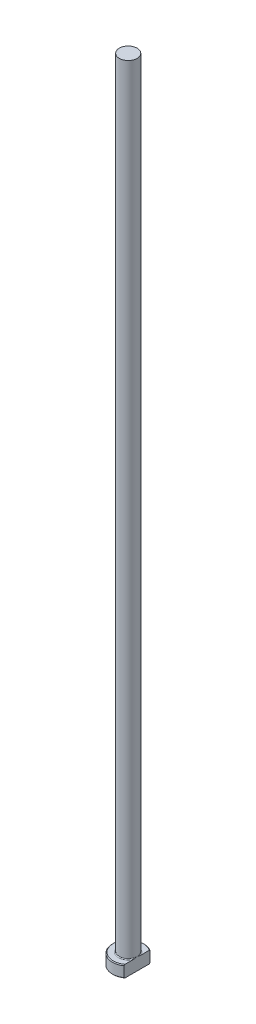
ISO-10303-21;
HEADER;
FILE_DESCRIPTION(('STEP AP214'),'2;1');
FILE_NAME('part.step','',(''),(''),'','','');
FILE_SCHEMA(('AUTOMOTIVE_DESIGN { 1 0 10303 214 1 1 1 1 }'));
ENDSEC;
DATA;
#1=APPLICATION_CONTEXT('core data for automotive mechanical design processes');
#2=APPLICATION_PROTOCOL_DEFINITION('international standard','automotive_design',2000,#1);
#3=PRODUCT_CONTEXT('',#1,'mechanical');
#4=PRODUCT('Part','Part','',(#3));
#5=PRODUCT_RELATED_PRODUCT_CATEGORY('part','',(#4));
#6=PRODUCT_DEFINITION_FORMATION('','',#4);
#7=PRODUCT_DEFINITION_CONTEXT('part definition',#1,'design');
#8=PRODUCT_DEFINITION('design','',#6,#7);
#9=PRODUCT_DEFINITION_SHAPE('','',#8);
#10=(LENGTH_UNIT() NAMED_UNIT(*) SI_UNIT(.MILLI.,.METRE.));
#11=(NAMED_UNIT(*) PLANE_ANGLE_UNIT() SI_UNIT($,.RADIAN.));
#12=(NAMED_UNIT(*) SI_UNIT($,.STERADIAN.) SOLID_ANGLE_UNIT());
#13=UNCERTAINTY_MEASURE_WITH_UNIT(LENGTH_MEASURE(1.E-05),#10,'distance_accuracy_value','');
#14=(GEOMETRIC_REPRESENTATION_CONTEXT(3) GLOBAL_UNCERTAINTY_ASSIGNED_CONTEXT((#13)) GLOBAL_UNIT_ASSIGNED_CONTEXT((#10,
#11,#12)) REPRESENTATION_CONTEXT('',''));
#15=CARTESIAN_POINT('',(0.,0.,0.));
#16=DIRECTION('',(0.,0.,1.));
#17=DIRECTION('',(1.,0.,0.));
#18=AXIS2_PLACEMENT_3D('',#15,#16,#17);
#19=CARTESIAN_POINT('',(0.,0.,0.));
#20=DIRECTION('',(0.,-1.,0.));
#21=DIRECTION('',(0.,0.,-1.));
#22=AXIS2_PLACEMENT_3D('',#19,#20,#21);
#23=PLANE('',#22);
#24=CARTESIAN_POINT('',(0.,0.,0.));
#25=DIRECTION('',(0.,-1.,0.));
#26=DIRECTION('',(0.,0.,-1.));
#27=AXIS2_PLACEMENT_3D('',#24,#25,#26);
#28=CIRCLE('',#27,3.79999999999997);
#29=CARTESIAN_POINT('',(2.24999999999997,0.,3.0622703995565));
#30=VERTEX_POINT('',#29);
#31=CARTESIAN_POINT('',(2.24999999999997,0.,-3.0622703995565));
#32=VERTEX_POINT('',#31);
#33=EDGE_CURVE('E98',#30,#32,#28,.T.);
#34=ORIENTED_EDGE('',*,*,#33,.T.);
#35=DIRECTION('',(0.,0.,1.));
#36=VECTOR('',#35,1.);
#37=CARTESIAN_POINT('',(2.24999999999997,0.,-3.30718913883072));
#38=LINE('',#37,#36);
#39=EDGE_CURVE('E83',#32,#30,#38,.T.);
#40=ORIENTED_EDGE('',*,*,#39,.T.);
#41=EDGE_LOOP('',(#34,#40));
#42=FACE_BOUND('',#41,.T.);
#43=ADVANCED_FACE('F32',(#42),#23,.T.);
#44=CARTESIAN_POINT('',(0.,259.958771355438,0.));
#45=DIRECTION('',(0.,1.,0.));
#46=DIRECTION('',(0.,0.,1.));
#47=AXIS2_PLACEMENT_3D('',#44,#45,#46);
#48=CYLINDRICAL_SURFACE('',#47,3.99999999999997);
#49=CARTESIAN_POINT('',(0.,2.80000000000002,0.));
#50=DIRECTION('',(0.,1.,0.));
#51=DIRECTION('',(0.,0.,1.));
#52=AXIS2_PLACEMENT_3D('',#49,#50,#51);
#53=CIRCLE('',#52,3.99999999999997);
#54=CARTESIAN_POINT('',(2.24999999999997,2.80000000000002,3.30718913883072));
#55=VERTEX_POINT('',#54);
#56=CARTESIAN_POINT('',(2.24999999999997,2.80000000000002,-3.30718913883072));
#57=VERTEX_POINT('',#56);
#58=EDGE_CURVE('E104',#55,#57,#53,.F.);
#59=ORIENTED_EDGE('',*,*,#58,.T.);
#60=DIRECTION('',(0.,-1.,0.));
#61=VECTOR('',#60,1.);
#62=CARTESIAN_POINT('',(2.24999999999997,200.,-3.30718913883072));
#63=LINE('',#62,#61);
#64=CARTESIAN_POINT('',(2.24999999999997,0.199999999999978,-3.30718913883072));
#65=VERTEX_POINT('',#64);
#66=EDGE_CURVE('E183',#57,#65,#63,.T.);
#67=ORIENTED_EDGE('',*,*,#66,.T.);
#68=CARTESIAN_POINT('',(0.,0.199999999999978,0.));
#69=DIRECTION('',(0.,-1.,0.));
#70=DIRECTION('',(0.,0.,-1.));
#71=AXIS2_PLACEMENT_3D('',#68,#69,#70);
#72=CIRCLE('',#71,3.99999999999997);
#73=CARTESIAN_POINT('',(2.24999999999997,0.199999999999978,3.30718913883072));
#74=VERTEX_POINT('',#73);
#75=EDGE_CURVE('E100',#65,#74,#72,.F.);
#76=ORIENTED_EDGE('',*,*,#75,.T.);
#77=DIRECTION('',(0.,-1.,0.));
#78=VECTOR('',#77,1.);
#79=CARTESIAN_POINT('',(2.24999999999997,200.,3.30718913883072));
#80=LINE('',#79,#78);
#81=EDGE_CURVE('E93',#55,#74,#80,.T.);
#82=ORIENTED_EDGE('',*,*,#81,.F.);
#83=EDGE_LOOP('',(#59,#67,#76,#82));
#84=FACE_BOUND('',#83,.T.);
#85=ADVANCED_FACE('F158',(#84),#48,.T.);
#86=CARTESIAN_POINT('',(-3.99999999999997,3.,0.));
#87=DIRECTION('',(0.,1.,0.));
#88=DIRECTION('',(0.,0.,1.));
#89=AXIS2_PLACEMENT_3D('',#86,#87,#88);
#90=PLANE('',#89);
#91=CARTESIAN_POINT('',(0.,3.,0.));
#92=DIRECTION('',(0.,1.,0.));
#93=DIRECTION('',(0.,0.,1.));
#94=AXIS2_PLACEMENT_3D('',#91,#92,#93);
#95=CIRCLE('',#94,3.80000000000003);
#96=CARTESIAN_POINT('',(2.24999999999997,3.,-3.06227039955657));
#97=VERTEX_POINT('',#96);
#98=CARTESIAN_POINT('',(2.24999999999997,3.,3.06227039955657));
#99=VERTEX_POINT('',#98);
#100=EDGE_CURVE('E178',#97,#99,#95,.T.);
#101=ORIENTED_EDGE('',*,*,#100,.T.);
#102=DIRECTION('',(0.,0.,-1.));
#103=VECTOR('',#102,1.);
#104=CARTESIAN_POINT('',(2.24999999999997,3.,0.));
#105=LINE('',#104,#103);
#106=CARTESIAN_POINT('',(2.24999999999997,2.99999999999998,0.969535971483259));
#107=VERTEX_POINT('',#106);
#108=EDGE_CURVE('E57',#99,#107,#105,.T.);
#109=ORIENTED_EDGE('',*,*,#108,.T.);
#110=CARTESIAN_POINT('',(0.,3.,0.));
#111=DIRECTION('',(0.,1.,0.));
#112=DIRECTION('',(0.,0.,1.));
#113=AXIS2_PLACEMENT_3D('',#110,#111,#112);
#114=CIRCLE('',#113,2.44999999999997);
#115=CARTESIAN_POINT('',(2.24999999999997,2.99999999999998,-0.969535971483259));
#116=VERTEX_POINT('',#115);
#117=EDGE_CURVE('E107',#107,#116,#114,.F.);
#118=ORIENTED_EDGE('',*,*,#117,.T.);
#119=EDGE_CURVE('E136',#116,#97,#105,.T.);
#120=ORIENTED_EDGE('',*,*,#119,.T.);
#121=EDGE_LOOP('',(#101,#109,#118,#120));
#122=FACE_BOUND('',#121,.T.);
#123=ADVANCED_FACE('F147',(#122),#90,.T.);
#124=CARTESIAN_POINT('',(0.,3.,0.));
#125=DIRECTION('',(0.,-1.,0.));
#126=DIRECTION('',(0.,0.,-1.));
#127=AXIS2_PLACEMENT_3D('',#124,#125,#126);
#128=CONICAL_SURFACE('',#127,3.80000000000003,0.785398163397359);
#129=ORIENTED_EDGE('',*,*,#58,.F.);
#130=CARTESIAN_POINT('',(2.24999999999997,-0.817697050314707,7.27782992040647));
#131=CARTESIAN_POINT('',(2.24999999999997,-0.691332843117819,7.14556140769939));
#132=CARTESIAN_POINT('',(2.24999999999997,-0.565122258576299,7.01314597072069));
#133=CARTESIAN_POINT('',(2.24999999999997,-0.31307114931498,6.74796170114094));
#134=CARTESIAN_POINT('',(2.24999999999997,-0.187230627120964,6.61519286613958));
#135=CARTESIAN_POINT('',(2.24999999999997,0.189705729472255,6.21619905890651));
#136=CARTESIAN_POINT('',(2.24999999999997,0.440149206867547,5.94935693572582));
#137=CARTESIAN_POINT('',(2.24999999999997,0.940260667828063,5.41146981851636));
#138=CARTESIAN_POINT('',(2.24999999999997,1.18991116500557,5.14040850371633));
#139=CARTESIAN_POINT('',(2.24999999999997,1.56140055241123,4.73113683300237));
#140=CARTESIAN_POINT('',(2.24999999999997,1.68472451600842,4.59427552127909));
#141=CARTESIAN_POINT('',(2.24999999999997,1.93009407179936,4.31941326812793));
#142=CARTESIAN_POINT('',(2.24999999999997,2.05213967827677,4.18141233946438));
#143=CARTESIAN_POINT('',(2.24999999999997,2.31419582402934,3.88150807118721));
#144=CARTESIAN_POINT('',(2.24999999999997,2.45391708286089,3.71935099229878));
#145=CARTESIAN_POINT('',(2.24999999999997,2.73025215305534,3.39234412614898));
#146=CARTESIAN_POINT('',(2.24999999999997,2.86686529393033,3.22749377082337));
#147=CARTESIAN_POINT('',(2.24999999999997,3.13534139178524,2.89430849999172));
#148=CARTESIAN_POINT('',(2.24999999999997,3.26721073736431,2.72597879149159));
#149=CARTESIAN_POINT('',(2.24999999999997,3.45966785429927,2.46950762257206));
#150=CARTESIAN_POINT('',(2.24999999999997,3.52291962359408,2.38336821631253));
#151=CARTESIAN_POINT('',(2.24999999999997,3.64714184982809,2.2094641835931));
#152=CARTESIAN_POINT('',(2.24999999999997,3.7081125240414,2.12169971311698));
#153=CARTESIAN_POINT('',(2.24999999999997,3.82102230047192,1.95327886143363));
#154=CARTESIAN_POINT('',(2.24999999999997,3.87324695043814,1.87281476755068));
#155=CARTESIAN_POINT('',(2.24999999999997,3.97467249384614,1.70998172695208));
#156=CARTESIAN_POINT('',(2.24999999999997,4.02387305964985,1.62761257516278));
#157=CARTESIAN_POINT('',(2.24999999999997,4.11837607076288,1.46059799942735));
#158=CARTESIAN_POINT('',(2.24999999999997,4.16367708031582,1.37595175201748));
#159=CARTESIAN_POINT('',(2.24999999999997,4.24914050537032,1.20413766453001));
#160=CARTESIAN_POINT('',(2.24999999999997,4.28930406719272,1.11697039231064));
#161=CARTESIAN_POINT('',(2.24999999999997,4.38314726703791,0.891175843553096));
#162=CARTESIAN_POINT('',(2.24999999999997,4.43219749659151,0.750488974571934));
#163=CARTESIAN_POINT('',(2.24999999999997,4.48826674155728,0.535159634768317));
#164=CARTESIAN_POINT('',(2.24999999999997,4.50402844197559,0.462776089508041));
#165=CARTESIAN_POINT('',(2.24999999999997,4.52893388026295,0.316860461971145));
#166=CARTESIAN_POINT('',(2.24999999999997,4.53807847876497,0.243328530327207));
#167=CARTESIAN_POINT('',(2.24999999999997,4.54922474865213,0.0949504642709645));
#168=CARTESIAN_POINT('',(2.24999999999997,4.55115152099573,0.0200986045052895));
#169=CARTESIAN_POINT('',(2.24999999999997,4.54752076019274,-0.129420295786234));
#170=CARTESIAN_POINT('',(2.24999999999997,4.54196316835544,-0.204087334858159));
#171=CARTESIAN_POINT('',(2.24999999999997,4.52372329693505,-0.352688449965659));
#172=CARTESIAN_POINT('',(2.24999999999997,4.51102617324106,-0.426620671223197));
#173=CARTESIAN_POINT('',(2.24999999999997,4.47926333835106,-0.573094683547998));
#174=CARTESIAN_POINT('',(2.24999999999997,4.46019612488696,-0.645636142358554));
#175=CARTESIAN_POINT('',(2.24999999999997,4.40610994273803,-0.823701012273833));
#176=CARTESIAN_POINT('',(2.24999999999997,4.36783449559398,-0.928230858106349));
#177=CARTESIAN_POINT('',(2.24999999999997,4.28232692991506,-1.13354070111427));
#178=CARTESIAN_POINT('',(2.24999999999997,4.23508812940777,-1.23431783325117));
#179=CARTESIAN_POINT('',(2.24999999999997,4.13380125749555,-1.43298762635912));
#180=CARTESIAN_POINT('',(2.24999999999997,4.07972026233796,-1.53086330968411));
#181=CARTESIAN_POINT('',(2.24999999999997,3.9949620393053,-1.67548648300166));
#182=CARTESIAN_POINT('',(2.24999999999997,3.96610811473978,-1.72332162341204));
#183=CARTESIAN_POINT('',(2.24999999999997,3.90734436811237,-1.81833709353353));
#184=CARTESIAN_POINT('',(2.24999999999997,3.87743458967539,-1.86551745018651));
#185=CARTESIAN_POINT('',(2.24999999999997,3.7750959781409,-2.02354622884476));
#186=CARTESIAN_POINT('',(2.24999999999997,3.70057106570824,-2.13303820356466));
#187=CARTESIAN_POINT('',(2.24999999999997,3.54784662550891,-2.34943854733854));
#188=CARTESIAN_POINT('',(2.24999999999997,3.46964624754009,-2.45634630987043));
#189=CARTESIAN_POINT('',(2.24999999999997,3.31046802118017,-2.66818697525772));
#190=CARTESIAN_POINT('',(2.24999999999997,3.22948822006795,-2.77311840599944));
#191=CARTESIAN_POINT('',(2.24999999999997,3.06545223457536,-2.98134898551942));
#192=CARTESIAN_POINT('',(2.24999999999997,2.98239592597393,-3.08464803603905));
#193=CARTESIAN_POINT('',(2.24999999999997,2.7304425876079,-3.39308007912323));
#194=CARTESIAN_POINT('',(2.24999999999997,2.55914389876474,-3.59624854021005));
#195=CARTESIAN_POINT('',(2.24999999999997,2.21260420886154,-3.99901521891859));
#196=CARTESIAN_POINT('',(2.24999999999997,2.03736490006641,-4.19861490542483));
#197=CARTESIAN_POINT('',(2.24999999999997,1.68403823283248,-4.59551245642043));
#198=CARTESIAN_POINT('',(2.24999999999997,1.50594904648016,-4.79280869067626));
#199=CARTESIAN_POINT('',(2.24999999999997,1.14782580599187,-5.18566037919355));
#200=CARTESIAN_POINT('',(2.24999999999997,0.967791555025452,-5.38121565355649));
#201=CARTESIAN_POINT('',(2.24999999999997,0.606519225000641,-5.77078870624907));
#202=CARTESIAN_POINT('',(2.24999999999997,0.425282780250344,-5.96480800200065));
#203=CARTESIAN_POINT('',(2.24999999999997,0.0617463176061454,-6.35184762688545));
#204=CARTESIAN_POINT('',(2.24999999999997,-0.120553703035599,-6.5448679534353));
#205=CARTESIAN_POINT('',(2.24999999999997,-0.38887673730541,-6.82775668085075));
#206=CARTESIAN_POINT('',(2.24999999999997,-0.474578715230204,-6.91792994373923));
#207=CARTESIAN_POINT('',(2.24999999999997,-0.64606226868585,-7.09803491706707));
#208=CARTESIAN_POINT('',(2.24999999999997,-0.731843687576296,-7.1879667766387));
#209=CARTESIAN_POINT('',(2.24999999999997,-0.817697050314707,-7.27782992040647));
#210=B_SPLINE_CURVE_WITH_KNOTS('',3,(#130,#131,#132,#133,#134,#135,#136,#137,#138,#139,#140,
#141,#142,#143,#144,#145,#146,#147,#148,#149,#150,#151,#152,#153,#154,#155,#156,#157,#158,#159,
#160,#161,#162,#163,#164,#165,#166,#167,#168,#169,#170,#171,#172,#173,#174,#175,#176,#177,#178,
#179,#180,#181,#182,#183,#184,#185,#186,#187,#188,#189,#190,#191,#192,#193,#194,#195,#196,#197,
#198,#199,#200,#201,#202,#203,#204,#205,#206,#207,#208,#209),.UNSPECIFIED.,.F.,.F.,(4,2,2,2,2,2,
2,2,2,2,2,2,2,2,2,2,2,2,2,2,2,2,2,2,2,2,2,2,2,2,2,2,2,2,2,2,2,2,2,4),(0.,0.548785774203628,
1.09757528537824,2.19544562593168,3.30094607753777,3.85362276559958,4.40629327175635,
5.04841012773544,5.69066421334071,6.33201824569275,6.65259523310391,6.9731416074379,
7.26086761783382,7.54862474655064,7.83648737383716,8.12428565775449,8.56956070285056,
8.7915473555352,9.01350513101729,9.23775987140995,9.46201637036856,9.68674086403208,
9.91151839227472,10.2448678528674,10.5784668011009,10.9137368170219,11.0813178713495,
11.2488920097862,11.6461164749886,12.0434332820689,12.4410351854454,12.8386609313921,
13.6357991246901,14.4326012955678,15.2299368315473,16.0273538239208,16.8238479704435,
17.6203441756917,17.993552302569,18.3664002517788),.UNSPECIFIED.);
#211=EDGE_CURVE('E135',#55,#99,#210,.T.);
#212=ORIENTED_EDGE('',*,*,#211,.T.);
#213=ORIENTED_EDGE('',*,*,#100,.F.);
#214=EDGE_CURVE('E127',#97,#57,#210,.T.);
#215=ORIENTED_EDGE('',*,*,#214,.T.);
#216=EDGE_LOOP('',(#129,#212,#213,#215));
#217=FACE_BOUND('',#216,.T.);
#218=ADVANCED_FACE('F143',(#217),#128,.T.);
#219=CARTESIAN_POINT('',(0.,0.199999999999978,0.));
#220=DIRECTION('',(0.,1.,0.));
#221=DIRECTION('',(0.,0.,1.));
#222=AXIS2_PLACEMENT_3D('',#219,#220,#221);
#223=CONICAL_SURFACE('',#222,3.99999999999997,0.785398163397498);
#224=ORIENTED_EDGE('',*,*,#75,.F.);
#225=CARTESIAN_POINT('',(2.24999999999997,3.8176970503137,-7.27782992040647));
#226=CARTESIAN_POINT('',(2.24999999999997,3.69133284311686,-7.14556140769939));
#227=CARTESIAN_POINT('',(2.24999999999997,3.56512225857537,-7.01314597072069));
#228=CARTESIAN_POINT('',(2.24999999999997,3.31307114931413,-6.74796170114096));
#229=CARTESIAN_POINT('',(2.24999999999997,3.18723062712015,-6.6151928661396));
#230=CARTESIAN_POINT('',(2.24999999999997,2.81029427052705,-6.21619905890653));
#231=CARTESIAN_POINT('',(2.24999999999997,2.55985079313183,-5.94935693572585));
#232=CARTESIAN_POINT('',(2.24999999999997,2.05973933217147,-5.4114698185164));
#233=CARTESIAN_POINT('',(2.24999999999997,1.81008883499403,-5.14040850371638));
#234=CARTESIAN_POINT('',(2.24999999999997,1.43859944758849,-4.73113683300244));
#235=CARTESIAN_POINT('',(2.24999999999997,1.31527548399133,-4.59427552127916));
#236=CARTESIAN_POINT('',(2.24999999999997,1.06990592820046,-4.319413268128));
#237=CARTESIAN_POINT('',(2.24999999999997,0.947860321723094,-4.18141233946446));
#238=CARTESIAN_POINT('',(2.24999999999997,0.685804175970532,-3.88150807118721));
#239=CARTESIAN_POINT('',(2.24999999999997,0.546082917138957,-3.71935099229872));
#240=CARTESIAN_POINT('',(2.24999999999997,0.269747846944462,-3.39234412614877));
#241=CARTESIAN_POINT('',(2.24999999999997,0.133134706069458,-3.22749377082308));
#242=CARTESIAN_POINT('',(2.24999999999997,-0.135341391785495,-2.89430849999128));
#243=CARTESIAN_POINT('',(2.24999999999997,-0.267210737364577,-2.72597879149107));
#244=CARTESIAN_POINT('',(2.24999999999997,-0.459667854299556,-2.46950762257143));
#245=CARTESIAN_POINT('',(2.24999999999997,-0.522919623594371,-2.38336821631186));
#246=CARTESIAN_POINT('',(2.24999999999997,-0.64714184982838,-2.20946418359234));
#247=CARTESIAN_POINT('',(2.24999999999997,-0.708112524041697,-2.12169971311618));
#248=CARTESIAN_POINT('',(2.24999999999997,-0.821022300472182,-1.9532788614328));
#249=CARTESIAN_POINT('',(2.24999999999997,-0.87324695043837,-1.87281476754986));
#250=CARTESIAN_POINT('',(2.24999999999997,-0.974672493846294,-1.70998172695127));
#251=CARTESIAN_POINT('',(2.24999999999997,-1.02387305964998,-1.62761257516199));
#252=CARTESIAN_POINT('',(2.24999999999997,-1.11837607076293,-1.46059799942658));
#253=CARTESIAN_POINT('',(2.24999999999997,-1.16367708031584,-1.37595175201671));
#254=CARTESIAN_POINT('',(2.24999999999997,-1.24914050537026,-1.20413766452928));
#255=CARTESIAN_POINT('',(2.24999999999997,-1.28930406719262,-1.11697039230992));
#256=CARTESIAN_POINT('',(2.24999999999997,-1.38314726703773,-0.891175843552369));
#257=CARTESIAN_POINT('',(2.24999999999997,-1.43219749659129,-0.750488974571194));
#258=CARTESIAN_POINT('',(2.24999999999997,-1.48826674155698,-0.535159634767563));
#259=CARTESIAN_POINT('',(2.24999999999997,-1.50402844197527,-0.462776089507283));
#260=CARTESIAN_POINT('',(2.24999999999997,-1.52893388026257,-0.316860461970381));
#261=CARTESIAN_POINT('',(2.24999999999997,-1.53807847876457,-0.243328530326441));
#262=CARTESIAN_POINT('',(2.24999999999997,-1.54922474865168,-0.0949504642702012));
#263=CARTESIAN_POINT('',(2.24999999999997,-1.55115152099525,-0.02009860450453));
#264=CARTESIAN_POINT('',(2.24999999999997,-1.54752076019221,0.129420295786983));
#265=CARTESIAN_POINT('',(2.24999999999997,-1.54196316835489,0.204087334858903));
#266=CARTESIAN_POINT('',(2.24999999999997,-1.52372329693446,0.35268844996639));
#267=CARTESIAN_POINT('',(2.24999999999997,-1.51102617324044,0.426620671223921));
#268=CARTESIAN_POINT('',(2.24999999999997,-1.47926333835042,0.573094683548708));
#269=CARTESIAN_POINT('',(2.24999999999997,-1.46019612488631,0.645636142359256));
#270=CARTESIAN_POINT('',(2.24999999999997,-1.40610994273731,0.823701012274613));
#271=CARTESIAN_POINT('',(2.24999999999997,-1.36783449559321,0.928230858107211));
#272=CARTESIAN_POINT('',(2.24999999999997,-1.28232692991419,1.1335407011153));
#273=CARTESIAN_POINT('',(2.24999999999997,-1.23508812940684,1.23431783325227));
#274=CARTESIAN_POINT('',(2.24999999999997,-1.1338012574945,1.43298762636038));
#275=CARTESIAN_POINT('',(2.24999999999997,-1.07972026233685,1.53086330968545));
#276=CARTESIAN_POINT('',(2.24999999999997,-0.994962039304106,1.6754864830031));
#277=CARTESIAN_POINT('',(2.24999999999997,-0.966108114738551,1.72332162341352));
#278=CARTESIAN_POINT('',(2.24999999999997,-0.907344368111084,1.81833709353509));
#279=CARTESIAN_POINT('',(2.24999999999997,-0.877434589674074,1.8655174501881));
#280=CARTESIAN_POINT('',(2.24999999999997,-0.775095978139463,2.0235462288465));
#281=CARTESIAN_POINT('',(2.24999999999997,-0.700571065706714,2.13303820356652));
#282=CARTESIAN_POINT('',(2.24999999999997,-0.547846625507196,2.34943854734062));
#283=CARTESIAN_POINT('',(2.24999999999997,-0.469646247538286,2.45634630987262));
#284=CARTESIAN_POINT('',(2.24999999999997,-0.310468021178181,2.66818697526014));
#285=CARTESIAN_POINT('',(2.24999999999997,-0.229488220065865,2.77311840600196));
#286=CARTESIAN_POINT('',(2.24999999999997,-0.0654522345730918,2.98134898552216));
#287=CARTESIAN_POINT('',(2.24999999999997,0.0176040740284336,3.0846480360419));
#288=CARTESIAN_POINT('',(2.24999999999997,0.269557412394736,3.39308007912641));
#289=CARTESIAN_POINT('',(2.24999999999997,0.440856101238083,3.59624854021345));
#290=CARTESIAN_POINT('',(2.24999999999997,0.78739579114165,3.99901521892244));
#291=CARTESIAN_POINT('',(2.24999999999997,0.962635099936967,4.1986149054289));
#292=CARTESIAN_POINT('',(2.24999999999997,1.31596176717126,4.59551245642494));
#293=CARTESIAN_POINT('',(2.24999999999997,1.49405095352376,4.79280869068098));
#294=CARTESIAN_POINT('',(2.24999999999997,1.85217419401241,5.18566037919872));
#295=CARTESIAN_POINT('',(2.24999999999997,2.03220844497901,5.38121565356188));
#296=CARTESIAN_POINT('',(2.24999999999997,2.39348077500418,5.7707887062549));
#297=CARTESIAN_POINT('',(2.24999999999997,2.57471721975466,5.9648080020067));
#298=CARTESIAN_POINT('',(2.24999999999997,2.93825368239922,6.35184762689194));
#299=CARTESIAN_POINT('',(2.24999999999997,3.12055370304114,6.54486795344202));
#300=CARTESIAN_POINT('',(2.24999999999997,3.38887673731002,6.82775668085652));
#301=CARTESIAN_POINT('',(2.24999999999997,3.47457871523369,6.91792994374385));
#302=CARTESIAN_POINT('',(2.24999999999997,3.64606226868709,7.09803491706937));
#303=CARTESIAN_POINT('',(2.24999999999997,3.73184368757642,7.18796677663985));
#304=CARTESIAN_POINT('',(2.24999999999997,3.81769705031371,7.27782992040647));
#305=B_SPLINE_CURVE_WITH_KNOTS('',3,(#225,#226,#227,#228,#229,#230,#231,#232,#233,#234,#235,
#236,#237,#238,#239,#240,#241,#242,#243,#244,#245,#246,#247,#248,#249,#250,#251,#252,#253,#254,
#255,#256,#257,#258,#259,#260,#261,#262,#263,#264,#265,#266,#267,#268,#269,#270,#271,#272,#273,
#274,#275,#276,#277,#278,#279,#280,#281,#282,#283,#284,#285,#286,#287,#288,#289,#290,#291,#292,
#293,#294,#295,#296,#297,#298,#299,#300,#301,#302,#303,#304),.UNSPECIFIED.,.F.,.F.,(4,2,2,2,2,2,
2,2,2,2,2,2,2,2,2,2,2,2,2,2,2,2,2,2,2,2,2,2,2,2,2,2,2,2,2,2,2,2,2,4),(0.,0.548785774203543,
1.09757528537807,2.19544562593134,3.30094607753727,3.85362276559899,4.40629327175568,
5.04841012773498,5.69066421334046,6.33201824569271,6.65259523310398,6.97314160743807,
7.26086761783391,7.54862474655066,7.8364873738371,8.12428565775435,8.5695607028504,
8.79154735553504,9.01350513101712,9.23775987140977,9.46201637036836,9.68674086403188,
9.91151839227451,10.2448678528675,10.5784668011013,10.9137368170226,11.0813178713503,
11.2488920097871,11.6461164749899,12.0434332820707,12.4410351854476,12.8386609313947,
13.6357991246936,14.4326012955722,15.2299368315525,16.0273538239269,16.8238479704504,
17.6203441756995,17.9935523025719,18.3664002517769),.UNSPECIFIED.);
#306=EDGE_CURVE('E86',#65,#32,#305,.T.);
#307=ORIENTED_EDGE('',*,*,#306,.T.);
#308=ORIENTED_EDGE('',*,*,#33,.F.);
#309=EDGE_CURVE('E89',#30,#74,#305,.T.);
#310=ORIENTED_EDGE('',*,*,#309,.T.);
#311=EDGE_LOOP('',(#224,#307,#308,#310));
#312=FACE_BOUND('',#311,.T.);
#313=ADVANCED_FACE('F97',(#312),#223,.T.);
#314=CARTESIAN_POINT('',(0.,3.19999999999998,0.));
#315=DIRECTION('',(0.,1.,0.));
#316=DIRECTION('',(0.,0.,1.));
#317=AXIS2_PLACEMENT_3D('',#314,#315,#316);
#318=TOROIDAL_SURFACE('',#317,2.44999999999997,0.2);
#319=CARTESIAN_POINT('',(2.24999999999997,3.19999999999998,0.));
#320=CARTESIAN_POINT('',(2.24999999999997,3.20000050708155,6.44724205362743E-11));
#321=CARTESIAN_POINT('',(2.24999999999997,3.20000101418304,-1.58891187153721E-07));
#322=CARTESIAN_POINT('',(2.24999999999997,3.20000197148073,-6.21779237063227E-07));
#323=CARTESIAN_POINT('',(2.24999999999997,3.20000241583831,-9.3446075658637E-07));
#324=CARTESIAN_POINT('',(2.24999999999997,3.20000332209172,-1.68105190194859E-06));
#325=CARTESIAN_POINT('',(2.24999999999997,3.20000377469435,-2.12646372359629E-06));
#326=CARTESIAN_POINT('',(2.24999999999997,3.20000460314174,-3.06333876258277E-06));
#327=CARTESIAN_POINT('',(2.24999999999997,3.20000498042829,-3.55360517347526E-06));
#328=CARTESIAN_POINT('',(2.24999999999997,3.20000633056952,-5.39956008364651E-06));
#329=CARTESIAN_POINT('',(2.24999999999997,3.20000722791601,-6.8123761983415E-06));
#330=CARTESIAN_POINT('',(2.24999999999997,3.200008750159,-9.65315882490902E-06));
#331=CARTESIAN_POINT('',(2.24999999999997,3.2000093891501,-1.10739426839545E-05));
#332=CARTESIAN_POINT('',(2.24999999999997,3.20001197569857,-1.69289386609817E-05));
#333=CARTESIAN_POINT('',(2.24999999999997,3.2000138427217,-2.1402980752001E-05));
#334=CARTESIAN_POINT('',(2.24999999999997,3.20001668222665,-2.99701699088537E-05));
#335=CARTESIAN_POINT('',(2.24999999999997,3.20001774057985,-3.40349906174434E-05));
#336=CARTESIAN_POINT('',(2.24999999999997,3.20002529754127,-6.37611258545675E-05));
#337=CARTESIAN_POINT('',(2.24999999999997,3.20003087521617,-8.9609528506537E-05));
#338=CARTESIAN_POINT('',(2.24999999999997,3.20005527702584,-0.000191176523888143));
#339=CARTESIAN_POINT('',(2.24999999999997,3.20007870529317,-0.000265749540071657));
#340=CARTESIAN_POINT('',(2.24999999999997,3.2001693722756,-0.000559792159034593));
#341=CARTESIAN_POINT('',(2.24999999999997,3.2002335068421,-0.000779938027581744));
#342=CARTESIAN_POINT('',(2.24999999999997,3.20048920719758,-0.00165050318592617));
#343=CARTESIAN_POINT('',(2.24999999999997,3.20068459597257,-0.00230007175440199));
#344=CARTESIAN_POINT('',(2.24999999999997,3.20149322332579,-0.00499620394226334));
#345=CARTESIAN_POINT('',(2.24999999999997,3.20210170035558,-0.00704382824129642));
#346=CARTESIAN_POINT('',(2.24999999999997,3.20797104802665,-0.0267853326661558));
#347=CARTESIAN_POINT('',(2.24999999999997,3.21325284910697,-0.0444747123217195));
#348=CARTESIAN_POINT('',(2.24999999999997,3.22356918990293,-0.0791736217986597));
#349=CARTESIAN_POINT('',(2.24999999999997,3.22860532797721,-0.0961827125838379));
#350=CARTESIAN_POINT('',(2.24999999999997,3.23925368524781,-0.132326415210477));
#351=CARTESIAN_POINT('',(2.24999999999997,3.24485983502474,-0.151462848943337));
#352=CARTESIAN_POINT('',(2.24999999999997,3.25603662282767,-0.18996857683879));
#353=CARTESIAN_POINT('',(2.24999999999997,3.26160623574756,-0.209338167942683));
#354=CARTESIAN_POINT('',(2.24999999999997,3.27500311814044,-0.25652385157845));
#355=CARTESIAN_POINT('',(2.24999999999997,3.28276182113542,-0.284359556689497));
#356=CARTESIAN_POINT('',(2.24999999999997,3.29771346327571,-0.339425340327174));
#357=CARTESIAN_POINT('',(2.24999999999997,3.30491576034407,-0.36665287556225));
#358=CARTESIAN_POINT('',(2.24999999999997,3.32240345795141,-0.43509070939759));
#359=CARTESIAN_POINT('',(2.24999999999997,3.33239618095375,-0.476377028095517));
#360=CARTESIAN_POINT('',(2.24999999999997,3.35100390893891,-0.559624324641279));
#361=CARTESIAN_POINT('',(2.24999999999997,3.3596067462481,-0.601588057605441));
#362=CARTESIAN_POINT('',(2.24999999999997,3.37543235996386,-0.689258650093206));
#363=CARTESIAN_POINT('',(2.24999999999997,3.38248971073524,-0.73499643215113));
#364=CARTESIAN_POINT('',(2.24999999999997,3.39342529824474,-0.826730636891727));
#365=CARTESIAN_POINT('',(2.24999999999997,3.39731270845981,-0.872725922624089));
#366=CARTESIAN_POINT('',(2.24999999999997,3.40071499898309,-0.963783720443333));
#367=CARTESIAN_POINT('',(2.24999999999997,3.40033773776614,-1.00884048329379));
#368=CARTESIAN_POINT('',(2.24999999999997,3.39535803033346,-1.07577565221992));
#369=CARTESIAN_POINT('',(2.24999999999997,3.39299580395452,-1.09781842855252));
#370=CARTESIAN_POINT('',(2.24999999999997,3.38649339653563,-1.14163100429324));
#371=CARTESIAN_POINT('',(2.24999999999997,3.38235512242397,-1.16340107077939));
#372=CARTESIAN_POINT('',(2.24999999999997,3.37178290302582,-1.20664751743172));
#373=CARTESIAN_POINT('',(2.24999999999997,3.36532376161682,-1.2281178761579));
#374=CARTESIAN_POINT('',(2.24999999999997,3.34940253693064,-1.26994619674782));
#375=CARTESIAN_POINT('',(2.24999999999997,3.33994859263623,-1.29030700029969));
#376=CARTESIAN_POINT('',(2.24999999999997,3.32341167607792,-1.3178414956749));
#377=CARTESIAN_POINT('',(2.24999999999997,3.31797729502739,-1.32600125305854));
#378=CARTESIAN_POINT('',(2.24999999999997,3.30618383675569,-1.34165219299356));
#379=CARTESIAN_POINT('',(2.24999999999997,3.29982370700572,-1.34914259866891));
#380=CARTESIAN_POINT('',(2.24999999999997,3.28597385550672,-1.36322511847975));
#381=CARTESIAN_POINT('',(2.24999999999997,3.27846961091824,-1.36980324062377));
#382=CARTESIAN_POINT('',(2.24999999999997,3.26235014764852,-1.3814177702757));
#383=CARTESIAN_POINT('',(2.24999999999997,3.25373945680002,-1.38646019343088));
#384=CARTESIAN_POINT('',(2.24999999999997,3.23893119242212,-1.39291408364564));
#385=CARTESIAN_POINT('',(2.24999999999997,3.23301804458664,-1.39497873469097));
#386=CARTESIAN_POINT('',(2.24999999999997,3.22092968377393,-1.3980973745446));
#387=CARTESIAN_POINT('',(2.24999999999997,3.21475469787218,-1.39915222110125));
#388=CARTESIAN_POINT('',(2.24999999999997,3.20229305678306,-1.4001597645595));
#389=CARTESIAN_POINT('',(2.24999999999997,3.19600609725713,-1.40010876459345));
#390=CARTESIAN_POINT('',(2.24999999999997,3.18353929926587,-1.39890051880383));
#391=CARTESIAN_POINT('',(2.24999999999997,3.17735949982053,-1.39774287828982));
#392=CARTESIAN_POINT('',(2.24999999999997,3.16550896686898,-1.39448677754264));
#393=CARTESIAN_POINT('',(2.24999999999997,3.15982782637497,-1.39242539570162));
#394=CARTESIAN_POINT('',(2.24999999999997,3.14882191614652,-1.38751374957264));
#395=CARTESIAN_POINT('',(2.24999999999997,3.14349727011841,-1.38466321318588));
#396=CARTESIAN_POINT('',(2.24999999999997,3.13026923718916,-1.37647479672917));
#397=CARTESIAN_POINT('',(2.24999999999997,3.12266499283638,-1.37065399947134));
#398=CARTESIAN_POINT('',(2.24999999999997,3.10845647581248,-1.35789458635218));
#399=CARTESIAN_POINT('',(2.24999999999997,3.10185542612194,-1.3509525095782));
#400=CARTESIAN_POINT('',(2.24999999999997,3.0855320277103,-1.33150080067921));
#401=CARTESIAN_POINT('',(2.24999999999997,3.07660573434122,-1.31832816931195));
#402=CARTESIAN_POINT('',(2.24999999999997,3.06078136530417,-1.29086374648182));
#403=CARTESIAN_POINT('',(2.24999999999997,3.05388481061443,-1.27657112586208));
#404=CARTESIAN_POINT('',(2.24999999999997,3.03602738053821,-1.23377116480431));
#405=CARTESIAN_POINT('',(2.24999999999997,3.02722778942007,-1.20437236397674));
#406=CARTESIAN_POINT('',(2.24999999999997,3.01362163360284,-1.14441037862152));
#407=CARTESIAN_POINT('',(2.24999999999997,3.00886464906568,-1.11383741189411));
#408=CARTESIAN_POINT('',(2.24999999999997,3.00105881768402,-1.03966563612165));
#409=CARTESIAN_POINT('',(2.24999999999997,2.99953171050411,-0.995912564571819));
#410=CARTESIAN_POINT('',(2.24999999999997,3.00070174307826,-0.908367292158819));
#411=CARTESIAN_POINT('',(2.24999999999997,3.00341475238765,-0.864575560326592));
#412=CARTESIAN_POINT('',(2.24999999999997,3.01171554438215,-0.779778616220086));
#413=CARTESIAN_POINT('',(2.24999999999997,3.01713219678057,-0.738755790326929));
#414=CARTESIAN_POINT('',(2.24999999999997,3.03001638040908,-0.657360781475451));
#415=CARTESIAN_POINT('',(2.24999999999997,3.03746816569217,-0.616986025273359));
#416=CARTESIAN_POINT('',(2.24999999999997,3.05405724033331,-0.535981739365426));
#417=CARTESIAN_POINT('',(2.24999999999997,3.06321733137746,-0.495356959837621));
#418=CARTESIAN_POINT('',(2.24999999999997,3.0829739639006,-0.413374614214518));
#419=CARTESIAN_POINT('',(2.24999999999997,3.09360096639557,-0.372024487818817));
#420=CARTESIAN_POINT('',(2.24999999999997,3.11230155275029,-0.302306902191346));
#421=CARTESIAN_POINT('',(2.24999999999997,3.12014883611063,-0.273877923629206));
#422=CARTESIAN_POINT('',(2.24999999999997,3.1360590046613,-0.21741165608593));
#423=CARTESIAN_POINT('',(2.24999999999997,3.14411864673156,-0.189373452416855));
#424=CARTESIAN_POINT('',(2.24999999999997,3.15951571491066,-0.136466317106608));
#425=CARTESIAN_POINT('',(2.24999999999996,3.16683378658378,-0.111591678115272));
#426=CARTESIAN_POINT('',(2.24999999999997,3.18187191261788,-0.0608432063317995));
#427=CARTESIAN_POINT('',(2.24999999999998,3.18959608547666,-0.0349705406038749));
#428=CARTESIAN_POINT('',(2.24999999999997,3.19789887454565,-0.00704171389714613));
#429=CARTESIAN_POINT('',(2.24999999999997,3.19850801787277,-0.00499199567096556));
#430=CARTESIAN_POINT('',(2.24999999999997,3.19931680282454,-0.00229537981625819));
#431=CARTESIAN_POINT('',(2.24999999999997,3.19951170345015,-0.00164742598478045));
#432=CARTESIAN_POINT('',(2.24999999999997,3.19976680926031,-0.000778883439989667));
#433=CARTESIAN_POINT('',(2.24999999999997,3.19983082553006,-0.000559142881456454));
#434=CARTESIAN_POINT('',(2.24999999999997,3.19992134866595,-0.000265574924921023));
#435=CARTESIAN_POINT('',(2.24999999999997,3.19994475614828,-0.000191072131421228));
#436=CARTESIAN_POINT('',(2.24999999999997,3.19996913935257,-8.958673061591E-05));
#437=CARTESIAN_POINT('',(2.24999999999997,3.19997471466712,-6.37485903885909E-05));
#438=CARTESIAN_POINT('',(2.24999999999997,3.19998226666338,-3.40328341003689E-05));
#439=CARTESIAN_POINT('',(2.24999999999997,3.19998332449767,-2.9968622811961E-05));
#440=CARTESIAN_POINT('',(2.24999999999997,3.1999861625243,-2.14026473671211E-05));
#441=CARTESIAN_POINT('',(2.24999999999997,3.19998802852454,-1.69291778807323E-05));
#442=CARTESIAN_POINT('',(2.24999999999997,3.19999061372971,-1.10747627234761E-05));
#443=CARTESIAN_POINT('',(2.24999999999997,3.19999125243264,-9.65402443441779E-06));
#444=CARTESIAN_POINT('',(2.24999999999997,3.19999277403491,-6.81328214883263E-06));
#445=CARTESIAN_POINT('',(2.24999999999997,3.19999367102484,-5.40045583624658E-06));
#446=CARTESIAN_POINT('',(2.24999999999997,3.19999502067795,-3.55442701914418E-06));
#447=CARTESIAN_POINT('',(2.24999999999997,3.19999539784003,-3.06412583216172E-06));
#448=CARTESIAN_POINT('',(2.24999999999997,3.19999622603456,-2.12715879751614E-06));
#449=CARTESIAN_POINT('',(2.24999999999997,3.19999667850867,-1.68168917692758E-06));
#450=CARTESIAN_POINT('',(2.24999999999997,3.19999758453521,-9.34960574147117E-07));
#451=CARTESIAN_POINT('',(2.24999999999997,3.19999802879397,-6.22203835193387E-07));
#452=CARTESIAN_POINT('',(2.24999999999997,3.1999989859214,-1.59128803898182E-07));
#453=CARTESIAN_POINT('',(2.24999999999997,3.19999949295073,-6.44683123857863E-11));
#454=CARTESIAN_POINT('',(2.24999999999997,3.19999999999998,0.));
#455=B_SPLINE_CURVE_WITH_KNOTS('',3,(#319,#320,#321,#322,#323,#324,#325,#326,#327,#328,#329,
#330,#331,#332,#333,#334,#335,#336,#337,#338,#339,#340,#341,#342,#343,#344,#345,#346,#347,#348,
#349,#350,#351,#352,#353,#354,#355,#356,#357,#358,#359,#360,#361,#362,#363,#364,#365,#366,#367,
#368,#369,#370,#371,#372,#373,#374,#375,#376,#377,#378,#379,#380,#381,#382,#383,#384,#385,#386,
#387,#388,#389,#390,#391,#392,#393,#394,#395,#396,#397,#398,#399,#400,#401,#402,#403,#404,#405,
#406,#407,#408,#409,#410,#411,#412,#413,#414,#415,#416,#417,#418,#419,#420,#421,#422,#423,#424,
#425,#426,#427,#428,#429,#430,#431,#432,#433,#434,#435,#436,#437,#438,#439,#440,#441,#442,#443,
#444,#445,#446,#447,#448,#449,#450,#451,#452,#453,#454),.UNSPECIFIED.,.T.,.F.,(4,2,2,2,2,2,2,2,
2,2,2,2,2,2,2,2,2,2,2,2,2,2,2,2,2,2,2,2,2,2,2,2,2,2,2,2,2,2,2,2,2,2,2,2,2,2,2,2,2,2,2,2,2,2,2,2,
2,2,2,2,2,2,2,2,2,2,2,4),(0.,1.52660891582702E-06,3.1524133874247E-06,5.04759848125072E-06,
6.90201355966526E-06,1.19024884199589E-05,1.65722258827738E-05,3.10841862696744E-05,
4.36688554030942E-05,0.000123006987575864,0.000357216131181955,0.00104540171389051,
0.00308000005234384,0.00948876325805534,0.0648698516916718,0.118087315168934,0.177909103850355,
0.238372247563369,0.325060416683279,0.409550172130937,0.53696552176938,0.665442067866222,
0.804194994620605,0.942544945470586,1.0774038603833,1.14385780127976,1.21024056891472,
1.27736693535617,1.34431241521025,1.37367425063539,1.40306973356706,1.432875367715,
1.46256269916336,1.48127715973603,1.49997570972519,1.51873677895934,1.53750454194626,
1.55556541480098,1.57363252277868,1.60219661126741,1.63085061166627,1.67831692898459,
1.72581872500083,1.81736829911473,1.91002510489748,2.04102939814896,2.17252517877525,
2.29658958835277,2.41972004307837,2.54462990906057,2.67269769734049,2.76117244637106,
2.84869182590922,2.92647873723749,3.00747864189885,3.01389398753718,3.01592352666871,
3.016610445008,3.01684443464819,3.01692374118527,3.0169363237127,3.01695083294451,
3.01695550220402,3.01696050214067,3.01696235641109,3.01696425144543,3.01696587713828,
3.01696740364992),.UNSPECIFIED.);
#456=CARTESIAN_POINT('',(2.24999999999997,3.19999999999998,0.));
#457=VERTEX_POINT('',#456);
#458=EDGE_CURVE('E11',#116,#457,#455,.T.);
#459=ORIENTED_EDGE('',*,*,#458,.F.);
#460=ORIENTED_EDGE('',*,*,#117,.F.);
#461=CARTESIAN_POINT('',(2.24999999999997,3.19999999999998,0.));
#462=CARTESIAN_POINT('',(2.24999999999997,3.19999949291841,-6.44723698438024E-11));
#463=CARTESIAN_POINT('',(2.24999999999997,3.19999898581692,1.58891187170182E-07));
#464=CARTESIAN_POINT('',(2.24999999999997,3.19999802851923,6.21779237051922E-07));
#465=CARTESIAN_POINT('',(2.24999999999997,3.19999758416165,9.34460756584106E-07));
#466=CARTESIAN_POINT('',(2.24999999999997,3.19999667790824,1.68105190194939E-06));
#467=CARTESIAN_POINT('',(2.24999999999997,3.19999622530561,2.12646372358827E-06));
#468=CARTESIAN_POINT('',(2.24999999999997,3.19999539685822,3.06333876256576E-06));
#469=CARTESIAN_POINT('',(2.24999999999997,3.19999501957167,3.55360517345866E-06));
#470=CARTESIAN_POINT('',(2.24999999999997,3.19999366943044,5.39956008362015E-06));
#471=CARTESIAN_POINT('',(2.24999999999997,3.19999277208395,6.81237619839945E-06));
#472=CARTESIAN_POINT('',(2.24999999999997,3.19999124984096,9.65315882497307E-06));
#473=CARTESIAN_POINT('',(2.24999999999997,3.19999061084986,1.1073942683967E-05));
#474=CARTESIAN_POINT('',(2.24999999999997,3.19998802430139,1.69289386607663E-05));
#475=CARTESIAN_POINT('',(2.24999999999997,3.19998615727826,2.14029807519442E-05));
#476=CARTESIAN_POINT('',(2.24999999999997,3.19998331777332,2.99701699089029E-05));
#477=CARTESIAN_POINT('',(2.24999999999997,3.19998225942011,3.40349906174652E-05));
#478=CARTESIAN_POINT('',(2.24999999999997,3.19997470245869,6.37611258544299E-05));
#479=CARTESIAN_POINT('',(2.24999999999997,3.19996912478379,8.96095285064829E-05));
#480=CARTESIAN_POINT('',(2.24999999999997,3.19994472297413,0.000191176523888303));
#481=CARTESIAN_POINT('',(2.24999999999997,3.19992129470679,0.00026574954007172));
#482=CARTESIAN_POINT('',(2.24999999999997,3.19983062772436,0.000559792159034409));
#483=CARTESIAN_POINT('',(2.24999999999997,3.19976649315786,0.000779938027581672));
#484=CARTESIAN_POINT('',(2.24999999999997,3.19951079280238,0.00165050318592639));
#485=CARTESIAN_POINT('',(2.24999999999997,3.19931540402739,0.00230007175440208));
#486=CARTESIAN_POINT('',(2.24999999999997,3.19850677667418,0.00499620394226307));
#487=CARTESIAN_POINT('',(2.24999999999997,3.19789829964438,0.0070438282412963));
#488=CARTESIAN_POINT('',(2.24999999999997,3.19202895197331,0.026785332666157));
#489=CARTESIAN_POINT('',(2.24999999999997,3.18674715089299,0.0444747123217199));
#490=CARTESIAN_POINT('',(2.24999999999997,3.17643081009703,0.0791736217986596));
#491=CARTESIAN_POINT('',(2.24999999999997,3.17139467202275,0.0961827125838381));
#492=CARTESIAN_POINT('',(2.24999999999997,3.16074631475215,0.132326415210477));
#493=CARTESIAN_POINT('',(2.24999999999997,3.15514016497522,0.151462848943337));
#494=CARTESIAN_POINT('',(2.24999999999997,3.14396337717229,0.18996857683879));
#495=CARTESIAN_POINT('',(2.24999999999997,3.1383937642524,0.209338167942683));
#496=CARTESIAN_POINT('',(2.24999999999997,3.12499688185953,0.25652385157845));
#497=CARTESIAN_POINT('',(2.24999999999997,3.11723817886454,0.284359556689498));
#498=CARTESIAN_POINT('',(2.24999999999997,3.10228653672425,0.339425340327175));
#499=CARTESIAN_POINT('',(2.24999999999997,3.09508423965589,0.36665287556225));
#500=CARTESIAN_POINT('',(2.24999999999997,3.07759654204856,0.435090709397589));
#501=CARTESIAN_POINT('',(2.24999999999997,3.06760381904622,0.476377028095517));
#502=CARTESIAN_POINT('',(2.24999999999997,3.04899609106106,0.559624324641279));
#503=CARTESIAN_POINT('',(2.24999999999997,3.04039325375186,0.601588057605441));
#504=CARTESIAN_POINT('',(2.24999999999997,3.0245676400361,0.689258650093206));
#505=CARTESIAN_POINT('',(2.24999999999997,3.01751028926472,0.73499643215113));
#506=CARTESIAN_POINT('',(2.24999999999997,3.00657470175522,0.826730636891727));
#507=CARTESIAN_POINT('',(2.24999999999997,3.00268729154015,0.872725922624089));
#508=CARTESIAN_POINT('',(2.24999999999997,2.99928500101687,0.963783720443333));
#509=CARTESIAN_POINT('',(2.24999999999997,2.99966226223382,1.00884048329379));
#510=CARTESIAN_POINT('',(2.24999999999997,3.0046419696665,1.07577565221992));
#511=CARTESIAN_POINT('',(2.24999999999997,3.00700419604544,1.09781842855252));
#512=CARTESIAN_POINT('',(2.24999999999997,3.01350660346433,1.14163100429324));
#513=CARTESIAN_POINT('',(2.24999999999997,3.017644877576,1.16340107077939));
#514=CARTESIAN_POINT('',(2.24999999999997,3.02821709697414,1.20664751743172));
#515=CARTESIAN_POINT('',(2.24999999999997,3.03467623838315,1.2281178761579));
#516=CARTESIAN_POINT('',(2.24999999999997,3.05059746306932,1.26994619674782));
#517=CARTESIAN_POINT('',(2.24999999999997,3.06005140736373,1.29030700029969));
#518=CARTESIAN_POINT('',(2.24999999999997,3.07658832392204,1.3178414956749));
#519=CARTESIAN_POINT('',(2.24999999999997,3.08202270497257,1.32600125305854));
#520=CARTESIAN_POINT('',(2.24999999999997,3.09381616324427,1.34165219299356));
#521=CARTESIAN_POINT('',(2.24999999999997,3.10017629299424,1.34914259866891));
#522=CARTESIAN_POINT('',(2.24999999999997,3.11402614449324,1.36322511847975));
#523=CARTESIAN_POINT('',(2.24999999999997,3.12153038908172,1.36980324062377));
#524=CARTESIAN_POINT('',(2.24999999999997,3.13764985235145,1.3814177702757));
#525=CARTESIAN_POINT('',(2.24999999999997,3.14626054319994,1.38646019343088));
#526=CARTESIAN_POINT('',(2.24999999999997,3.16106880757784,1.39291408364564));
#527=CARTESIAN_POINT('',(2.24999999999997,3.16698195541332,1.39497873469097));
#528=CARTESIAN_POINT('',(2.24999999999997,3.17907031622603,1.3980973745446));
#529=CARTESIAN_POINT('',(2.24999999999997,3.18524530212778,1.39915222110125));
#530=CARTESIAN_POINT('',(2.24999999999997,3.1977069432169,1.4001597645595));
#531=CARTESIAN_POINT('',(2.24999999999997,3.20399390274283,1.40010876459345));
#532=CARTESIAN_POINT('',(2.24999999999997,3.21646070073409,1.39890051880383));
#533=CARTESIAN_POINT('',(2.24999999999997,3.22264050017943,1.39774287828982));
#534=CARTESIAN_POINT('',(2.24999999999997,3.23449103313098,1.39448677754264));
#535=CARTESIAN_POINT('',(2.24999999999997,3.24017217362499,1.39242539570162));
#536=CARTESIAN_POINT('',(2.24999999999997,3.25117808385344,1.38751374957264));
#537=CARTESIAN_POINT('',(2.24999999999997,3.25650272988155,1.38466321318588));
#538=CARTESIAN_POINT('',(2.24999999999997,3.2697307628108,1.37647479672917));
#539=CARTESIAN_POINT('',(2.24999999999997,3.27733500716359,1.37065399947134));
#540=CARTESIAN_POINT('',(2.24999999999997,3.29154352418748,1.35789458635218));
#541=CARTESIAN_POINT('',(2.24999999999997,3.29814457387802,1.3509525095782));
#542=CARTESIAN_POINT('',(2.24999999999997,3.31446797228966,1.33150080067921));
#543=CARTESIAN_POINT('',(2.24999999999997,3.32339426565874,1.31832816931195));
#544=CARTESIAN_POINT('',(2.24999999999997,3.3392186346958,1.29086374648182));
#545=CARTESIAN_POINT('',(2.24999999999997,3.34611518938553,1.27657112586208));
#546=CARTESIAN_POINT('',(2.24999999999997,3.36397261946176,1.23377116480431));
#547=CARTESIAN_POINT('',(2.24999999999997,3.37277221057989,1.20437236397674));
#548=CARTESIAN_POINT('',(2.24999999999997,3.38637836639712,1.14441037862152));
#549=CARTESIAN_POINT('',(2.24999999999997,3.39113535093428,1.11383741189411));
#550=CARTESIAN_POINT('',(2.24999999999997,3.39894118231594,1.03966563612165));
#551=CARTESIAN_POINT('',(2.24999999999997,3.40046828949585,0.995912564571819));
#552=CARTESIAN_POINT('',(2.24999999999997,3.3992982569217,0.908367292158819));
#553=CARTESIAN_POINT('',(2.24999999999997,3.39658524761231,0.864575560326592));
#554=CARTESIAN_POINT('',(2.24999999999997,3.38828445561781,0.779778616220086));
#555=CARTESIAN_POINT('',(2.24999999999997,3.38286780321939,0.738755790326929));
#556=CARTESIAN_POINT('',(2.24999999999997,3.36998361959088,0.657360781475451));
#557=CARTESIAN_POINT('',(2.24999999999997,3.36253183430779,0.616986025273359));
#558=CARTESIAN_POINT('',(2.24999999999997,3.34594275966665,0.535981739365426));
#559=CARTESIAN_POINT('',(2.24999999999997,3.3367826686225,0.495356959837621));
#560=CARTESIAN_POINT('',(2.24999999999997,3.31702603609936,0.413374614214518));
#561=CARTESIAN_POINT('',(2.24999999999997,3.30639903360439,0.372024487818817));
#562=CARTESIAN_POINT('',(2.24999999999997,3.28769844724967,0.302306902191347));
#563=CARTESIAN_POINT('',(2.24999999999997,3.27985116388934,0.273877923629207));
#564=CARTESIAN_POINT('',(2.24999999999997,3.26394099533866,0.21741165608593));
#565=CARTESIAN_POINT('',(2.24999999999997,3.2558813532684,0.189373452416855));
#566=CARTESIAN_POINT('',(2.24999999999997,3.2404842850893,0.136466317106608));
#567=CARTESIAN_POINT('',(2.24999999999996,3.23316621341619,0.111591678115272));
#568=CARTESIAN_POINT('',(2.24999999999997,3.21812808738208,0.0608432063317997));
#569=CARTESIAN_POINT('',(2.24999999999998,3.2104039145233,0.0349705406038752));
#570=CARTESIAN_POINT('',(2.24999999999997,3.20210112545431,0.0070417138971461));
#571=CARTESIAN_POINT('',(2.24999999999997,3.20149198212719,0.00499199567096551));
#572=CARTESIAN_POINT('',(2.24999999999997,3.20068319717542,0.00229537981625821));
#573=CARTESIAN_POINT('',(2.24999999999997,3.20048829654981,0.00164742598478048));
#574=CARTESIAN_POINT('',(2.24999999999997,3.20023319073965,0.000778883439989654));
#575=CARTESIAN_POINT('',(2.24999999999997,3.20016917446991,0.00055914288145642));
#576=CARTESIAN_POINT('',(2.24999999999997,3.20007865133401,0.000265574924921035));
#577=CARTESIAN_POINT('',(2.24999999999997,3.20005524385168,0.000191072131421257));
#578=CARTESIAN_POINT('',(2.24999999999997,3.20003086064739,8.95867306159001E-05));
#579=CARTESIAN_POINT('',(2.24999999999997,3.20002528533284,6.37485903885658E-05));
#580=CARTESIAN_POINT('',(2.24999999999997,3.20001773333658,3.40328341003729E-05));
#581=CARTESIAN_POINT('',(2.24999999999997,3.20001667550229,2.996862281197E-05));
#582=CARTESIAN_POINT('',(2.24999999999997,3.20001383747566,2.14026473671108E-05));
#583=CARTESIAN_POINT('',(2.24999999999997,3.20001197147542,1.6929177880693E-05));
#584=CARTESIAN_POINT('',(2.24999999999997,3.20000938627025,1.10747627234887E-05));
#585=CARTESIAN_POINT('',(2.24999999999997,3.20000874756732,9.65402443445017E-06));
#586=CARTESIAN_POINT('',(2.24999999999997,3.20000722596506,6.81328214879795E-06));
#587=CARTESIAN_POINT('',(2.24999999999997,3.20000632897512,5.40045583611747E-06));
#588=CARTESIAN_POINT('',(2.24999999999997,3.20000497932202,3.55442701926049E-06));
#589=CARTESIAN_POINT('',(2.24999999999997,3.20000460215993,3.06412583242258E-06));
#590=CARTESIAN_POINT('',(2.24999999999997,3.2000037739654,2.1271587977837E-06));
#591=CARTESIAN_POINT('',(2.24999999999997,3.2000033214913,1.68168917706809E-06));
#592=CARTESIAN_POINT('',(2.24999999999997,3.20000241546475,9.34960574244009E-07));
#593=CARTESIAN_POINT('',(2.24999999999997,3.20000197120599,6.22203835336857E-07));
#594=CARTESIAN_POINT('',(2.24999999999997,3.20000101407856,1.5912880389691E-07));
#595=CARTESIAN_POINT('',(2.24999999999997,3.20000050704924,6.44682617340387E-11));
#596=CARTESIAN_POINT('',(2.24999999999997,3.19999999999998,0.));
#597=B_SPLINE_CURVE_WITH_KNOTS('',3,(#461,#462,#463,#464,#465,#466,#467,#468,#469,#470,#471,
#472,#473,#474,#475,#476,#477,#478,#479,#480,#481,#482,#483,#484,#485,#486,#487,#488,#489,#490,
#491,#492,#493,#494,#495,#496,#497,#498,#499,#500,#501,#502,#503,#504,#505,#506,#507,#508,#509,
#510,#511,#512,#513,#514,#515,#516,#517,#518,#519,#520,#521,#522,#523,#524,#525,#526,#527,#528,
#529,#530,#531,#532,#533,#534,#535,#536,#537,#538,#539,#540,#541,#542,#543,#544,#545,#546,#547,
#548,#549,#550,#551,#552,#553,#554,#555,#556,#557,#558,#559,#560,#561,#562,#563,#564,#565,#566,
#567,#568,#569,#570,#571,#572,#573,#574,#575,#576,#577,#578,#579,#580,#581,#582,#583,#584,#585,
#586,#587,#588,#589,#590,#591,#592,#593,#594,#595,#596),.UNSPECIFIED.,.T.,.F.,(4,2,2,2,2,2,2,2,
2,2,2,2,2,2,2,2,2,2,2,2,2,2,2,2,2,2,2,2,2,2,2,2,2,2,2,2,2,2,2,2,2,2,2,2,2,2,2,2,2,2,2,2,2,2,2,2,
2,2,2,2,2,2,2,2,2,2,2,4),(0.,1.52660891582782E-06,3.15241338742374E-06,5.04759848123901E-06,
6.90201355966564E-06,1.19024884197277E-05,1.65722258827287E-05,3.10841862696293E-05,
4.36688554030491E-05,0.000123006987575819,0.00035721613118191,0.00104540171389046,
0.0030800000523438,0.00948876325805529,0.0648698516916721,0.118087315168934,0.177909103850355,
0.238372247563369,0.325060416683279,0.409550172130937,0.53696552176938,0.665442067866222,
0.804194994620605,0.942544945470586,1.0774038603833,1.14385780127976,1.21024056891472,
1.27736693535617,1.34431241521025,1.37367425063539,1.40306973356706,1.432875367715,
1.46256269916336,1.48127715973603,1.49997570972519,1.51873677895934,1.53750454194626,
1.55556541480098,1.57363252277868,1.60219661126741,1.63085061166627,1.67831692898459,
1.72581872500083,1.81736829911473,1.91002510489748,2.04102939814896,2.17252517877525,
2.29658958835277,2.41972004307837,2.54462990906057,2.67269769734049,2.76117244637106,
2.84869182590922,2.92647873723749,3.00747864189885,3.01389398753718,3.01592352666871,
3.016610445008,3.01684443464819,3.01692374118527,3.0169363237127,3.01695083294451,
3.01695550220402,3.01696050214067,3.01696235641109,3.01696425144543,3.01696587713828,
3.01696740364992),.UNSPECIFIED.);
#598=EDGE_CURVE('E46',#457,#107,#597,.T.);
#599=ORIENTED_EDGE('',*,*,#598,.F.);
#600=CARTESIAN_POINT('',(0.,3.19999999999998,0.));
#601=DIRECTION('',(0.,1.,0.));
#602=DIRECTION('',(0.,0.,1.));
#603=AXIS2_PLACEMENT_3D('',#600,#601,#602);
#604=CIRCLE('',#603,2.24999999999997);
#605=EDGE_CURVE('E103',#457,#457,#604,.T.);
#606=ORIENTED_EDGE('',*,*,#605,.F.);
#607=EDGE_LOOP('',(#459,#460,#599,#606));
#608=FACE_BOUND('',#607,.T.);
#609=ADVANCED_FACE('F34',(#608),#318,.F.);
#610=CARTESIAN_POINT('',(0.,259.958771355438,0.));
#611=DIRECTION('',(0.,1.,0.));
#612=DIRECTION('',(0.,0.,1.));
#613=AXIS2_PLACEMENT_3D('',#610,#611,#612);
#614=CYLINDRICAL_SURFACE('',#613,2.24999999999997);
#615=ORIENTED_EDGE('',*,*,#605,.T.);
#616=EDGE_LOOP('',(#615));
#617=FACE_BOUND('',#616,.T.);
#618=CARTESIAN_POINT('',(0.,200.,0.));
#619=DIRECTION('',(0.,1.,0.));
#620=DIRECTION('',(0.,0.,1.));
#621=AXIS2_PLACEMENT_3D('',#618,#619,#620);
#622=CIRCLE('',#621,2.24999999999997);
#623=CARTESIAN_POINT('',(0.,200.,2.24999999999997));
#624=VERTEX_POINT('',#623);
#625=EDGE_CURVE('E101',#624,#624,#622,.T.);
#626=ORIENTED_EDGE('',*,*,#625,.F.);
#627=EDGE_LOOP('',(#626));
#628=FACE_BOUND('',#627,.T.);
#629=ADVANCED_FACE('F155',(#617,#628),#614,.T.);
#630=CARTESIAN_POINT('',(-2.24999999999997,200.,0.));
#631=DIRECTION('',(0.,1.,0.));
#632=DIRECTION('',(0.,0.,1.));
#633=AXIS2_PLACEMENT_3D('',#630,#631,#632);
#634=PLANE('',#633);
#635=ORIENTED_EDGE('',*,*,#625,.T.);
#636=EDGE_LOOP('',(#635));
#637=FACE_BOUND('',#636,.T.);
#638=ADVANCED_FACE('F121',(#637),#634,.T.);
#639=CARTESIAN_POINT('',(2.24999999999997,200.,-3.30718913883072));
#640=DIRECTION('',(1.,0.,0.));
#641=DIRECTION('',(0.,0.,-1.));
#642=AXIS2_PLACEMENT_3D('',#639,#640,#641);
#643=PLANE('',#642);
#644=ORIENTED_EDGE('',*,*,#66,.F.);
#645=ORIENTED_EDGE('',*,*,#214,.F.);
#646=ORIENTED_EDGE('',*,*,#119,.F.);
#647=ORIENTED_EDGE('',*,*,#458,.T.);
#648=ORIENTED_EDGE('',*,*,#598,.T.);
#649=ORIENTED_EDGE('',*,*,#108,.F.);
#650=ORIENTED_EDGE('',*,*,#211,.F.);
#651=ORIENTED_EDGE('',*,*,#81,.T.);
#652=ORIENTED_EDGE('',*,*,#309,.F.);
#653=ORIENTED_EDGE('',*,*,#39,.F.);
#654=ORIENTED_EDGE('',*,*,#306,.F.);
#655=EDGE_LOOP('',(#644,#645,#646,#647,#648,#649,#650,#651,#652,#653,#654));
#656=FACE_BOUND('',#655,.T.);
#657=ADVANCED_FACE('F85',(#656),#643,.T.);
#658=CLOSED_SHELL('',(#43,#85,#123,#218,#313,#609,#629,#638,#657));
#659=MANIFOLD_SOLID_BREP('B2',#658);
#660=ADVANCED_BREP_SHAPE_REPRESENTATION('',(#18,#659),#14);
#661=SHAPE_DEFINITION_REPRESENTATION(#9,#660);
ENDSEC;
END-ISO-10303-21;
